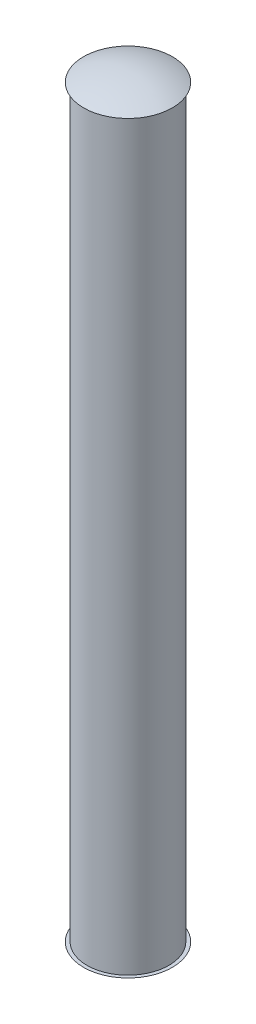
ISO-10303-21;
HEADER;
FILE_DESCRIPTION(('STEP AP214'),'2;1');
FILE_NAME('part.step','',(''),(''),'','','');
FILE_SCHEMA(('AUTOMOTIVE_DESIGN { 1 0 10303 214 1 1 1 1 }'));
ENDSEC;
DATA;
#1=APPLICATION_CONTEXT('core data for automotive mechanical design processes');
#2=APPLICATION_PROTOCOL_DEFINITION('international standard','automotive_design',2000,#1);
#3=PRODUCT_CONTEXT('',#1,'mechanical');
#4=PRODUCT('Part','Part','',(#3));
#5=PRODUCT_RELATED_PRODUCT_CATEGORY('part','',(#4));
#6=PRODUCT_DEFINITION_FORMATION('','',#4);
#7=PRODUCT_DEFINITION_CONTEXT('part definition',#1,'design');
#8=PRODUCT_DEFINITION('design','',#6,#7);
#9=PRODUCT_DEFINITION_SHAPE('','',#8);
#10=(LENGTH_UNIT() NAMED_UNIT(*) SI_UNIT(.MILLI.,.METRE.));
#11=(NAMED_UNIT(*) PLANE_ANGLE_UNIT() SI_UNIT($,.RADIAN.));
#12=(NAMED_UNIT(*) SI_UNIT($,.STERADIAN.) SOLID_ANGLE_UNIT());
#13=UNCERTAINTY_MEASURE_WITH_UNIT(LENGTH_MEASURE(1.E-05),#10,'distance_accuracy_value','');
#14=(GEOMETRIC_REPRESENTATION_CONTEXT(3) GLOBAL_UNCERTAINTY_ASSIGNED_CONTEXT((#13)) GLOBAL_UNIT_ASSIGNED_CONTEXT((#10,
#11,#12)) REPRESENTATION_CONTEXT('',''));
#15=CARTESIAN_POINT('',(0.,0.,0.));
#16=DIRECTION('',(0.,0.,1.));
#17=DIRECTION('',(1.,0.,0.));
#18=AXIS2_PLACEMENT_3D('',#15,#16,#17);
#19=CARTESIAN_POINT('',(0.,10.5409617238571,0.0284066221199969));
#20=DIRECTION('',(-1.,0.,0.));
#21=DIRECTION('',(0.,0.,1.));
#22=AXIS2_PLACEMENT_3D('',#19,#20,#21);
#23=CIRCLE('',#22,10.541);
#24=TRIMMED_CURVE('',#23,(PARAMETER_VALUE(-1.57349119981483)),
(PARAMETER_VALUE(1.57349119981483)),.T.,.PARAMETER.);
#25=CARTESIAN_POINT('',(0.,10.5409617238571,0.));
#26=DIRECTION('',(0.,1.,0.));
#27=AXIS1_PLACEMENT('',#25,#26);
#28=SURFACE_OF_REVOLUTION('',#24,#27);
#29=CARTESIAN_POINT('',(0.,1.016,0.));
#30=DIRECTION('',(0.,1.,0.));
#31=DIRECTION('',(0.,0.,1.));
#32=AXIS2_PLACEMENT_3D('',#29,#30,#31);
#33=CIRCLE('',#32,4.54369013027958);
#34=CARTESIAN_POINT('',(0.,1.016,4.54369013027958));
#35=VERTEX_POINT('',#34);
#36=EDGE_CURVE('E11',#35,#35,#33,.T.);
#37=ORIENTED_EDGE('',*,*,#36,.F.);
#38=EDGE_LOOP('',(#37));
#39=FACE_BOUND('',#38,.T.);
#40=CARTESIAN_POINT('',(0.,0.,0.));
#41=VERTEX_POINT('',#40);
#42=VERTEX_LOOP('',#41);
#43=FACE_BOUND('',#42,.T.);
#44=ADVANCED_FACE('F30',(#39,#43),#28,.T.);
#45=CARTESIAN_POINT('',(4.54369013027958,1.016,0.));
#46=DIRECTION('',(0.,-1.,0.));
#47=DIRECTION('',(0.,0.,-1.));
#48=AXIS2_PLACEMENT_3D('',#45,#46,#47);
#49=PLANE('',#48);
#50=CARTESIAN_POINT('',(0.,1.016,0.));
#51=DIRECTION('',(0.,1.,0.));
#52=DIRECTION('',(0.,0.,1.));
#53=AXIS2_PLACEMENT_3D('',#50,#51,#52);
#54=CIRCLE('',#53,4.191);
#55=CARTESIAN_POINT('',(0.,1.016,4.191));
#56=VERTEX_POINT('',#55);
#57=EDGE_CURVE('E36',#56,#56,#54,.T.);
#58=ORIENTED_EDGE('',*,*,#57,.F.);
#59=EDGE_LOOP('',(#58));
#60=FACE_BOUND('',#59,.T.);
#61=ORIENTED_EDGE('',*,*,#36,.T.);
#62=EDGE_LOOP('',(#61));
#63=FACE_BOUND('',#62,.T.);
#64=ADVANCED_FACE('F40',(#60,#63),#49,.F.);
#65=CARTESIAN_POINT('',(0.,74.1343373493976,0.));
#66=DIRECTION('',(0.,1.,0.));
#67=DIRECTION('',(0.,0.,1.));
#68=AXIS2_PLACEMENT_3D('',#65,#66,#67);
#69=CYLINDRICAL_SURFACE('',#68,4.191);
#70=CARTESIAN_POINT('',(0.,77.216,0.));
#71=DIRECTION('',(0.,1.,0.));
#72=DIRECTION('',(0.,0.,1.));
#73=AXIS2_PLACEMENT_3D('',#70,#71,#72);
#74=CIRCLE('',#73,4.191);
#75=CARTESIAN_POINT('',(0.,77.216,4.191));
#76=VERTEX_POINT('',#75);
#77=EDGE_CURVE('E68',#76,#76,#74,.T.);
#78=ORIENTED_EDGE('',*,*,#77,.F.);
#79=EDGE_LOOP('',(#78));
#80=FACE_BOUND('',#79,.T.);
#81=ORIENTED_EDGE('',*,*,#57,.T.);
#82=EDGE_LOOP('',(#81));
#83=FACE_BOUND('',#82,.T.);
#84=ADVANCED_FACE('F45',(#80,#83),#69,.T.);
#85=CARTESIAN_POINT('',(4.191,77.216,0.));
#86=DIRECTION('',(0.,1.,0.));
#87=DIRECTION('',(0.,0.,1.));
#88=AXIS2_PLACEMENT_3D('',#85,#86,#87);
#89=PLANE('',#88);
#90=CARTESIAN_POINT('',(0.,77.216,0.));
#91=DIRECTION('',(0.,1.,0.));
#92=DIRECTION('',(0.,0.,1.));
#93=AXIS2_PLACEMENT_3D('',#90,#91,#92);
#94=CIRCLE('',#93,4.54369013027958);
#95=CARTESIAN_POINT('',(0.,77.216,4.54369013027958));
#96=VERTEX_POINT('',#95);
#97=EDGE_CURVE('E67',#96,#96,#94,.T.);
#98=ORIENTED_EDGE('',*,*,#97,.F.);
#99=EDGE_LOOP('',(#98));
#100=FACE_BOUND('',#99,.T.);
#101=ORIENTED_EDGE('',*,*,#77,.T.);
#102=EDGE_LOOP('',(#101));
#103=FACE_BOUND('',#102,.T.);
#104=ADVANCED_FACE('F52',(#100,#103),#89,.F.);
#105=CARTESIAN_POINT('',(0.,67.564,0.));
#106=DIRECTION('',(0.,1.,0.));
#107=DIRECTION('',(1.,0.,0.));
#108=AXIS2_PLACEMENT_3D('',#105,#106,#107);
#109=SPHERICAL_SURFACE('',#108,10.668);
#110=ORIENTED_EDGE('',*,*,#97,.T.);
#111=EDGE_LOOP('',(#110));
#112=FACE_BOUND('',#111,.T.);
#113=ADVANCED_FACE('F59',(#112),#109,.T.);
#114=CLOSED_SHELL('',(#44,#64,#84,#104,#113));
#115=MANIFOLD_SOLID_BREP('B2',#114);
#116=ADVANCED_BREP_SHAPE_REPRESENTATION('',(#18,#115),#14);
#117=SHAPE_DEFINITION_REPRESENTATION(#9,#116);
ENDSEC;
END-ISO-10303-21;
